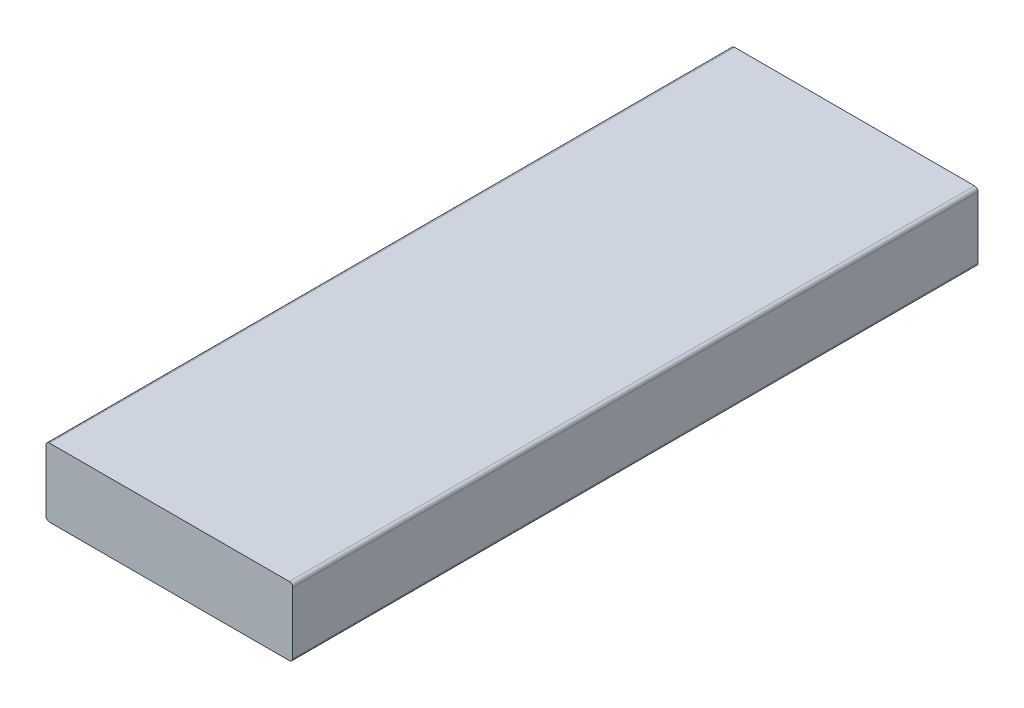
from build123d import *

# Parameters (mm, degrees)
SKETCH1_W           = 21.6
SKETCH1_H           = 6
BOSS_EXTRUDE1_DEPTH = 60
FILLET1_R           = 0.3


with BuildPart() as part:
    # Sketch1 → Boss-Extrude1 (new body)
    with BuildSketch(Plane.XY):
        Rectangle(SKETCH1_W, SKETCH1_H)
    extrude(amount=BOSS_EXTRUDE1_DEPTH)

    # Fillet1
    fillet1_edges = [part.edges().sort_by_distance(p)[0] for p in [
        (10.8, -3, 30),
        (-10.8, -3, 30),
        (-10.8, 3, 30),
        (10.8, 3, 30),
    ]]
    fillet(fillet1_edges, radius=FILLET1_R)


solid = part.part
